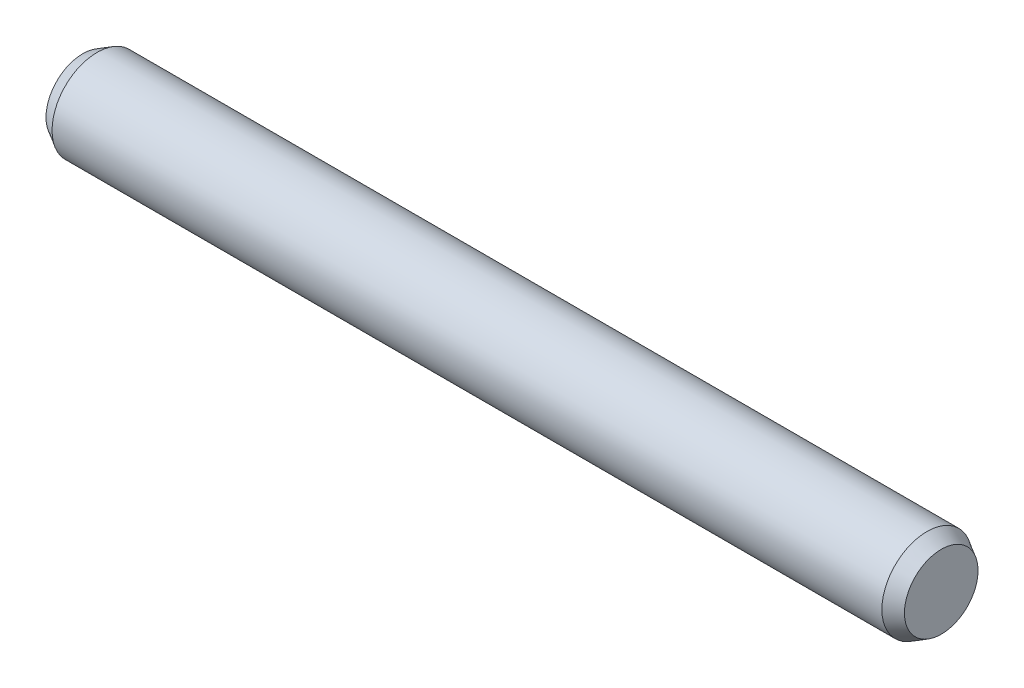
ISO-10303-21;
HEADER;
FILE_DESCRIPTION(('STEP AP214'),'2;1');
FILE_NAME('part.step','',(''),(''),'','','');
FILE_SCHEMA(('AUTOMOTIVE_DESIGN { 1 0 10303 214 1 1 1 1 }'));
ENDSEC;
DATA;
#1=APPLICATION_CONTEXT('core data for automotive mechanical design processes');
#2=APPLICATION_PROTOCOL_DEFINITION('international standard','automotive_design',2000,#1);
#3=PRODUCT_CONTEXT('',#1,'mechanical');
#4=PRODUCT('Part','Part','',(#3));
#5=PRODUCT_RELATED_PRODUCT_CATEGORY('part','',(#4));
#6=PRODUCT_DEFINITION_FORMATION('','',#4);
#7=PRODUCT_DEFINITION_CONTEXT('part definition',#1,'design');
#8=PRODUCT_DEFINITION('design','',#6,#7);
#9=PRODUCT_DEFINITION_SHAPE('','',#8);
#10=(LENGTH_UNIT() NAMED_UNIT(*) SI_UNIT(.MILLI.,.METRE.));
#11=(NAMED_UNIT(*) PLANE_ANGLE_UNIT() SI_UNIT($,.RADIAN.));
#12=(NAMED_UNIT(*) SI_UNIT($,.STERADIAN.) SOLID_ANGLE_UNIT());
#13=UNCERTAINTY_MEASURE_WITH_UNIT(LENGTH_MEASURE(1.E-05),#10,'distance_accuracy_value','');
#14=(GEOMETRIC_REPRESENTATION_CONTEXT(3) GLOBAL_UNCERTAINTY_ASSIGNED_CONTEXT((#13)) GLOBAL_UNIT_ASSIGNED_CONTEXT((#10,
#11,#12)) REPRESENTATION_CONTEXT('',''));
#15=CARTESIAN_POINT('',(0.,0.,0.));
#16=DIRECTION('',(0.,0.,1.));
#17=DIRECTION('',(1.,0.,0.));
#18=AXIS2_PLACEMENT_3D('',#15,#16,#17);
#19=CARTESIAN_POINT('',(0.,0.653353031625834,0.));
#20=DIRECTION('',(1.,0.,0.));
#21=DIRECTION('',(0.,0.,-1.));
#22=AXIS2_PLACEMENT_3D('',#19,#20,#21);
#23=PLANE('',#22);
#24=CARTESIAN_POINT('',(0.,0.,0.));
#25=DIRECTION('',(-1.,0.,0.));
#26=DIRECTION('',(0.,0.,1.));
#27=AXIS2_PLACEMENT_3D('',#24,#25,#26);
#28=CIRCLE('',#27,0.653353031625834);
#29=CARTESIAN_POINT('',(0.,0.,0.653353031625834));
#30=VERTEX_POINT('',#29);
#31=EDGE_CURVE('E42',#30,#30,#28,.T.);
#32=ORIENTED_EDGE('',*,*,#31,.T.);
#33=EDGE_LOOP('',(#32));
#34=FACE_BOUND('',#33,.T.);
#35=ADVANCED_FACE('F28',(#34),#23,.F.);
#36=CARTESIAN_POINT('',(15.24,0.,0.));
#37=DIRECTION('',(-1.,0.,0.));
#38=DIRECTION('',(0.,0.,1.));
#39=AXIS2_PLACEMENT_3D('',#36,#37,#38);
#40=PLANE('',#39);
#41=CARTESIAN_POINT('',(15.24,0.,0.));
#42=DIRECTION('',(-1.,0.,0.));
#43=DIRECTION('',(0.,0.,1.));
#44=AXIS2_PLACEMENT_3D('',#41,#42,#43);
#45=CIRCLE('',#44,0.653353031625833);
#46=CARTESIAN_POINT('',(15.24,0.,0.653353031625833));
#47=VERTEX_POINT('',#46);
#48=EDGE_CURVE('E10',#47,#47,#45,.T.);
#49=ORIENTED_EDGE('',*,*,#48,.F.);
#50=EDGE_LOOP('',(#49));
#51=FACE_BOUND('',#50,.T.);
#52=ADVANCED_FACE('F62',(#51),#40,.F.);
#53=CARTESIAN_POINT('',(15.24,0.,0.));
#54=DIRECTION('',(-1.,0.,0.));
#55=DIRECTION('',(0.,0.,1.));
#56=AXIS2_PLACEMENT_3D('',#53,#54,#55);
#57=CONICAL_SURFACE('',#56,0.653353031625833,0.523598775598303);
#58=CARTESIAN_POINT('',(14.986,0.,0.));
#59=DIRECTION('',(-1.,0.,0.));
#60=DIRECTION('',(0.,0.,1.));
#61=AXIS2_PLACEMENT_3D('',#58,#59,#60);
#62=CIRCLE('',#61,0.8);
#63=CARTESIAN_POINT('',(14.986,0.,0.8));
#64=VERTEX_POINT('',#63);
#65=EDGE_CURVE('E34',#64,#64,#62,.T.);
#66=ORIENTED_EDGE('',*,*,#65,.F.);
#67=EDGE_LOOP('',(#66));
#68=FACE_BOUND('',#67,.T.);
#69=ORIENTED_EDGE('',*,*,#48,.T.);
#70=EDGE_LOOP('',(#69));
#71=FACE_BOUND('',#70,.T.);
#72=ADVANCED_FACE('F57',(#68,#71),#57,.T.);
#73=CARTESIAN_POINT('',(0.,0.,0.));
#74=DIRECTION('',(-1.,0.,0.));
#75=DIRECTION('',(0.,0.,1.));
#76=AXIS2_PLACEMENT_3D('',#73,#74,#75);
#77=CYLINDRICAL_SURFACE('',#76,0.8);
#78=CARTESIAN_POINT('',(0.254000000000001,0.,0.));
#79=DIRECTION('',(-1.,0.,0.));
#80=DIRECTION('',(0.,0.,1.));
#81=AXIS2_PLACEMENT_3D('',#78,#79,#80);
#82=CIRCLE('',#81,0.8);
#83=CARTESIAN_POINT('',(0.254000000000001,0.,0.8));
#84=VERTEX_POINT('',#83);
#85=EDGE_CURVE('E38',#84,#84,#82,.T.);
#86=ORIENTED_EDGE('',*,*,#85,.F.);
#87=EDGE_LOOP('',(#86));
#88=FACE_BOUND('',#87,.T.);
#89=ORIENTED_EDGE('',*,*,#65,.T.);
#90=EDGE_LOOP('',(#89));
#91=FACE_BOUND('',#90,.T.);
#92=ADVANCED_FACE('F52',(#88,#91),#77,.T.);
#93=CARTESIAN_POINT('',(0.254000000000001,0.,0.));
#94=DIRECTION('',(1.,0.,0.));
#95=DIRECTION('',(0.,0.,-1.));
#96=AXIS2_PLACEMENT_3D('',#93,#94,#95);
#97=CONICAL_SURFACE('',#96,0.8,0.5235987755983);
#98=ORIENTED_EDGE('',*,*,#31,.F.);
#99=EDGE_LOOP('',(#98));
#100=FACE_BOUND('',#99,.T.);
#101=ORIENTED_EDGE('',*,*,#85,.T.);
#102=EDGE_LOOP('',(#101));
#103=FACE_BOUND('',#102,.T.);
#104=ADVANCED_FACE('F49',(#100,#103),#97,.T.);
#105=CLOSED_SHELL('',(#35,#52,#72,#92,#104));
#106=MANIFOLD_SOLID_BREP('B2',#105);
#107=ADVANCED_BREP_SHAPE_REPRESENTATION('',(#18,#106),#14);
#108=SHAPE_DEFINITION_REPRESENTATION(#9,#107);
ENDSEC;
END-ISO-10303-21;
